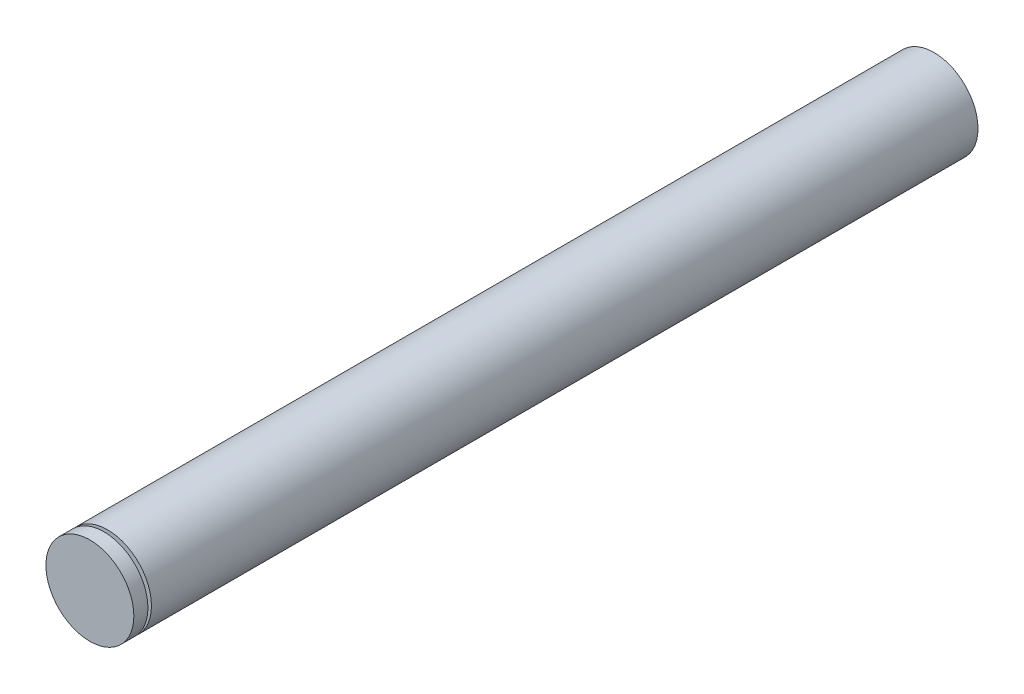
from build123d import *

# Parameters (mm, degrees)
ESQUISSE1_R        = 25
BOSS_EXTRU_1_DEPTH = 480
ESQUISSE2_W        = 2
ESQUISSE2_H        = 7


with BuildPart() as part:
    # Esquisse1 → Boss.-Extru.1 (new body)
    with BuildSketch(Plane.XY):
        Circle(ESQUISSE1_R)
    extrude(amount=BOSS_EXTRU_1_DEPTH)

    # Esquisse2 → Enl_vement de mati_re-R_volution1 (revolve, cut)
    with BuildSketch(Plane(origin=(0, 0, 0), x_dir=(0, 0, -1), z_dir=(1, 0, 0)), mode=Mode.PRIVATE) as enl_vement_de_mati_re_r_volution1_sk:
        with Locations((-471, 21.5)):
            Rectangle(ESQUISSE2_W, ESQUISSE2_H)
    revolve(enl_vement_de_mati_re_r_volution1_sk.sketch.rotate(Axis((0, 0, 480), (0, 0, -1)), 90), axis=Axis((0, 0, 480), (0, 0, -1)), mode=Mode.SUBTRACT)


solid = part.part
